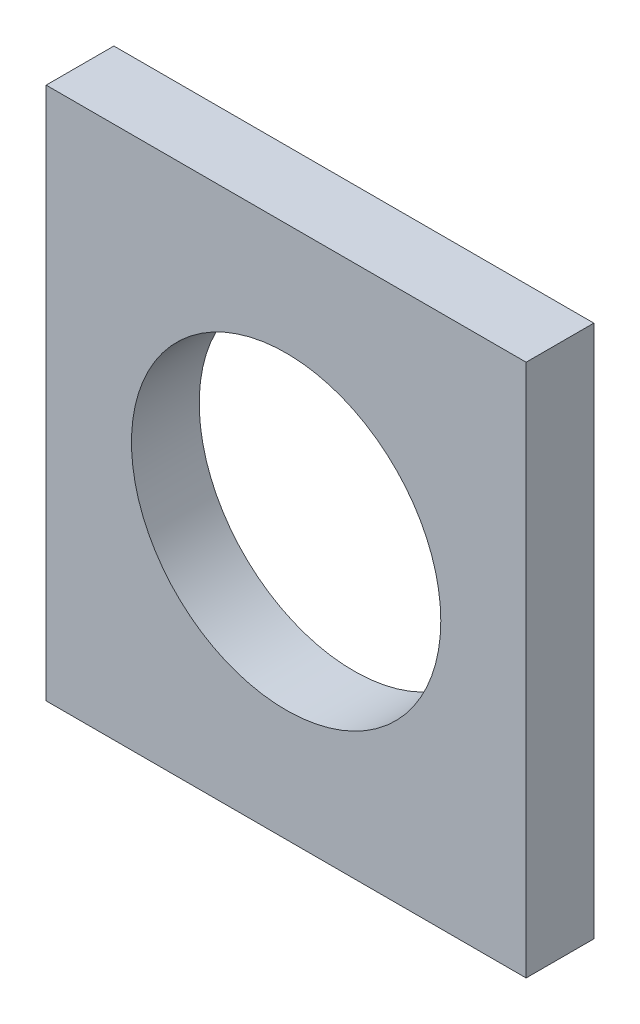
ISO-10303-21;
HEADER;
FILE_DESCRIPTION(('STEP AP214'),'2;1');
FILE_NAME('part.step','',(''),(''),'','','');
FILE_SCHEMA(('AUTOMOTIVE_DESIGN { 1 0 10303 214 1 1 1 1 }'));
ENDSEC;
DATA;
#1=APPLICATION_CONTEXT('core data for automotive mechanical design processes');
#2=APPLICATION_PROTOCOL_DEFINITION('international standard','automotive_design',2000,#1);
#3=PRODUCT_CONTEXT('',#1,'mechanical');
#4=PRODUCT('Part','Part','',(#3));
#5=PRODUCT_RELATED_PRODUCT_CATEGORY('part','',(#4));
#6=PRODUCT_DEFINITION_FORMATION('','',#4);
#7=PRODUCT_DEFINITION_CONTEXT('part definition',#1,'design');
#8=PRODUCT_DEFINITION('design','',#6,#7);
#9=PRODUCT_DEFINITION_SHAPE('','',#8);
#10=(LENGTH_UNIT() NAMED_UNIT(*) SI_UNIT(.MILLI.,.METRE.));
#11=(NAMED_UNIT(*) PLANE_ANGLE_UNIT() SI_UNIT($,.RADIAN.));
#12=(NAMED_UNIT(*) SI_UNIT($,.STERADIAN.) SOLID_ANGLE_UNIT());
#13=UNCERTAINTY_MEASURE_WITH_UNIT(LENGTH_MEASURE(1.E-05),#10,'distance_accuracy_value','');
#14=(GEOMETRIC_REPRESENTATION_CONTEXT(3) GLOBAL_UNCERTAINTY_ASSIGNED_CONTEXT((#13)) GLOBAL_UNIT_ASSIGNED_CONTEXT((#10,
#11,#12)) REPRESENTATION_CONTEXT('',''));
#15=CARTESIAN_POINT('',(0.,0.,0.));
#16=DIRECTION('',(0.,0.,1.));
#17=DIRECTION('',(1.,0.,0.));
#18=AXIS2_PLACEMENT_3D('',#15,#16,#17);
#19=CARTESIAN_POINT('',(0.,0.,6.35));
#20=DIRECTION('',(0.,0.,-1.));
#21=DIRECTION('',(-1.,0.,0.));
#22=AXIS2_PLACEMENT_3D('',#19,#20,#21);
#23=PLANE('',#22);
#24=DIRECTION('',(0.,-1.,0.));
#25=VECTOR('',#24,1.);
#26=CARTESIAN_POINT('',(0.,0.,6.35));
#27=LINE('',#26,#25);
#28=CARTESIAN_POINT('',(0.,50.,6.35));
#29=VERTEX_POINT('',#28);
#30=CARTESIAN_POINT('',(0.,0.,6.35));
#31=VERTEX_POINT('',#30);
#32=EDGE_CURVE('E96',#29,#31,#27,.T.);
#33=ORIENTED_EDGE('',*,*,#32,.T.);
#34=DIRECTION('',(1.,0.,0.));
#35=VECTOR('',#34,1.);
#36=CARTESIAN_POINT('',(0.,0.,6.35));
#37=LINE('',#36,#35);
#38=CARTESIAN_POINT('',(45.,0.,6.35));
#39=VERTEX_POINT('',#38);
#40=EDGE_CURVE('E91',#31,#39,#37,.T.);
#41=ORIENTED_EDGE('',*,*,#40,.T.);
#42=DIRECTION('',(0.,1.,0.));
#43=VECTOR('',#42,1.);
#44=CARTESIAN_POINT('',(45.,0.,6.35));
#45=LINE('',#44,#43);
#46=CARTESIAN_POINT('',(45.,50.,6.35));
#47=VERTEX_POINT('',#46);
#48=EDGE_CURVE('E94',#39,#47,#45,.T.);
#49=ORIENTED_EDGE('',*,*,#48,.T.);
#50=DIRECTION('',(-1.,0.,0.));
#51=VECTOR('',#50,1.);
#52=CARTESIAN_POINT('',(0.,50.,6.35));
#53=LINE('',#52,#51);
#54=EDGE_CURVE('E61',#47,#29,#53,.T.);
#55=ORIENTED_EDGE('',*,*,#54,.T.);
#56=EDGE_LOOP('',(#33,#41,#49,#55));
#57=FACE_BOUND('',#56,.T.);
#58=CARTESIAN_POINT('',(22.5,25.,6.35));
#59=DIRECTION('',(0.,0.,1.));
#60=DIRECTION('',(1.,0.,0.));
#61=AXIS2_PLACEMENT_3D('',#58,#59,#60);
#62=CIRCLE('',#61,14.5);
#63=CARTESIAN_POINT('',(37.,25.,6.35));
#64=VERTEX_POINT('',#63);
#65=EDGE_CURVE('E116',#64,#64,#62,.T.);
#66=ORIENTED_EDGE('',*,*,#65,.F.);
#67=EDGE_LOOP('',(#66));
#68=FACE_BOUND('',#67,.T.);
#69=ADVANCED_FACE('F43',(#57,#68),#23,.F.);
#70=CARTESIAN_POINT('',(0.,0.,0.));
#71=DIRECTION('',(0.,0.,-1.));
#72=DIRECTION('',(-1.,0.,0.));
#73=AXIS2_PLACEMENT_3D('',#70,#71,#72);
#74=PLANE('',#73);
#75=DIRECTION('',(0.,-1.,0.));
#76=VECTOR('',#75,1.);
#77=CARTESIAN_POINT('',(0.,0.,0.));
#78=LINE('',#77,#76);
#79=CARTESIAN_POINT('',(0.,50.,0.));
#80=VERTEX_POINT('',#79);
#81=CARTESIAN_POINT('',(0.,0.,0.));
#82=VERTEX_POINT('',#81);
#83=EDGE_CURVE('E112',#80,#82,#78,.T.);
#84=ORIENTED_EDGE('',*,*,#83,.F.);
#85=DIRECTION('',(-1.,0.,0.));
#86=VECTOR('',#85,1.);
#87=CARTESIAN_POINT('',(0.,50.,0.));
#88=LINE('',#87,#86);
#89=CARTESIAN_POINT('',(45.,50.,0.));
#90=VERTEX_POINT('',#89);
#91=EDGE_CURVE('E84',#90,#80,#88,.T.);
#92=ORIENTED_EDGE('',*,*,#91,.F.);
#93=DIRECTION('',(0.,1.,0.));
#94=VECTOR('',#93,1.);
#95=CARTESIAN_POINT('',(45.,0.,0.));
#96=LINE('',#95,#94);
#97=CARTESIAN_POINT('',(45.,0.,0.));
#98=VERTEX_POINT('',#97);
#99=EDGE_CURVE('E78',#98,#90,#96,.T.);
#100=ORIENTED_EDGE('',*,*,#99,.F.);
#101=DIRECTION('',(1.,0.,0.));
#102=VECTOR('',#101,1.);
#103=CARTESIAN_POINT('',(0.,0.,0.));
#104=LINE('',#103,#102);
#105=EDGE_CURVE('E101',#82,#98,#104,.T.);
#106=ORIENTED_EDGE('',*,*,#105,.F.);
#107=EDGE_LOOP('',(#84,#92,#100,#106));
#108=FACE_BOUND('',#107,.T.);
#109=CARTESIAN_POINT('',(22.5,25.,0.));
#110=DIRECTION('',(0.,0.,1.));
#111=DIRECTION('',(1.,0.,0.));
#112=AXIS2_PLACEMENT_3D('',#109,#110,#111);
#113=CIRCLE('',#112,14.5);
#114=CARTESIAN_POINT('',(37.,25.,0.));
#115=VERTEX_POINT('',#114);
#116=EDGE_CURVE('E134',#115,#115,#113,.T.);
#117=ORIENTED_EDGE('',*,*,#116,.T.);
#118=EDGE_LOOP('',(#117));
#119=FACE_BOUND('',#118,.T.);
#120=ADVANCED_FACE('F129',(#108,#119),#74,.T.);
#121=CARTESIAN_POINT('',(0.,0.,6.35));
#122=DIRECTION('',(1.,0.,0.));
#123=DIRECTION('',(0.,0.,-1.));
#124=AXIS2_PLACEMENT_3D('',#121,#122,#123);
#125=PLANE('',#124);
#126=ORIENTED_EDGE('',*,*,#83,.T.);
#127=DIRECTION('',(0.,0.,-1.));
#128=VECTOR('',#127,1.);
#129=CARTESIAN_POINT('',(0.,0.,6.35));
#130=LINE('',#129,#128);
#131=EDGE_CURVE('E11',#31,#82,#130,.T.);
#132=ORIENTED_EDGE('',*,*,#131,.F.);
#133=ORIENTED_EDGE('',*,*,#32,.F.);
#134=DIRECTION('',(0.,0.,-1.));
#135=VECTOR('',#134,1.);
#136=CARTESIAN_POINT('',(0.,50.,6.35));
#137=LINE('',#136,#135);
#138=EDGE_CURVE('E108',#29,#80,#137,.T.);
#139=ORIENTED_EDGE('',*,*,#138,.T.);
#140=EDGE_LOOP('',(#126,#132,#133,#139));
#141=FACE_BOUND('',#140,.T.);
#142=ADVANCED_FACE('F45',(#141),#125,.F.);
#143=CARTESIAN_POINT('',(0.,0.,6.35));
#144=DIRECTION('',(0.,1.,0.));
#145=DIRECTION('',(0.,0.,1.));
#146=AXIS2_PLACEMENT_3D('',#143,#144,#145);
#147=PLANE('',#146);
#148=ORIENTED_EDGE('',*,*,#105,.T.);
#149=DIRECTION('',(0.,0.,-1.));
#150=VECTOR('',#149,1.);
#151=CARTESIAN_POINT('',(45.,0.,6.35));
#152=LINE('',#151,#150);
#153=EDGE_CURVE('E53',#39,#98,#152,.T.);
#154=ORIENTED_EDGE('',*,*,#153,.F.);
#155=ORIENTED_EDGE('',*,*,#40,.F.);
#156=ORIENTED_EDGE('',*,*,#131,.T.);
#157=EDGE_LOOP('',(#148,#154,#155,#156));
#158=FACE_BOUND('',#157,.T.);
#159=ADVANCED_FACE('F100',(#158),#147,.F.);
#160=CARTESIAN_POINT('',(45.,0.,6.35));
#161=DIRECTION('',(-1.,0.,0.));
#162=DIRECTION('',(0.,0.,1.));
#163=AXIS2_PLACEMENT_3D('',#160,#161,#162);
#164=PLANE('',#163);
#165=ORIENTED_EDGE('',*,*,#99,.T.);
#166=DIRECTION('',(0.,0.,-1.));
#167=VECTOR('',#166,1.);
#168=CARTESIAN_POINT('',(45.,50.,6.35));
#169=LINE('',#168,#167);
#170=EDGE_CURVE('E103',#47,#90,#169,.T.);
#171=ORIENTED_EDGE('',*,*,#170,.F.);
#172=ORIENTED_EDGE('',*,*,#48,.F.);
#173=ORIENTED_EDGE('',*,*,#153,.T.);
#174=EDGE_LOOP('',(#165,#171,#172,#173));
#175=FACE_BOUND('',#174,.T.);
#176=ADVANCED_FACE('F104',(#175),#164,.F.);
#177=CARTESIAN_POINT('',(0.,50.,6.35));
#178=DIRECTION('',(0.,-1.,0.));
#179=DIRECTION('',(0.,0.,-1.));
#180=AXIS2_PLACEMENT_3D('',#177,#178,#179);
#181=PLANE('',#180);
#182=ORIENTED_EDGE('',*,*,#91,.T.);
#183=ORIENTED_EDGE('',*,*,#138,.F.);
#184=ORIENTED_EDGE('',*,*,#54,.F.);
#185=ORIENTED_EDGE('',*,*,#170,.T.);
#186=EDGE_LOOP('',(#182,#183,#184,#185));
#187=FACE_BOUND('',#186,.T.);
#188=ADVANCED_FACE('F126',(#187),#181,.F.);
#189=CARTESIAN_POINT('',(22.5,25.,6.35));
#190=DIRECTION('',(0.,0.,-1.));
#191=DIRECTION('',(-1.,0.,0.));
#192=AXIS2_PLACEMENT_3D('',#189,#190,#191);
#193=CYLINDRICAL_SURFACE('',#192,14.5);
#194=ORIENTED_EDGE('',*,*,#65,.T.);
#195=EDGE_LOOP('',(#194));
#196=FACE_BOUND('',#195,.T.);
#197=ORIENTED_EDGE('',*,*,#116,.F.);
#198=EDGE_LOOP('',(#197));
#199=FACE_BOUND('',#198,.T.);
#200=ADVANCED_FACE('F142',(#196,#199),#193,.F.);
#201=CLOSED_SHELL('',(#69,#120,#142,#159,#176,#188,#200));
#202=MANIFOLD_SOLID_BREP('B2',#201);
#203=ADVANCED_BREP_SHAPE_REPRESENTATION('',(#18,#202),#14);
#204=SHAPE_DEFINITION_REPRESENTATION(#9,#203);
ENDSEC;
END-ISO-10303-21;
